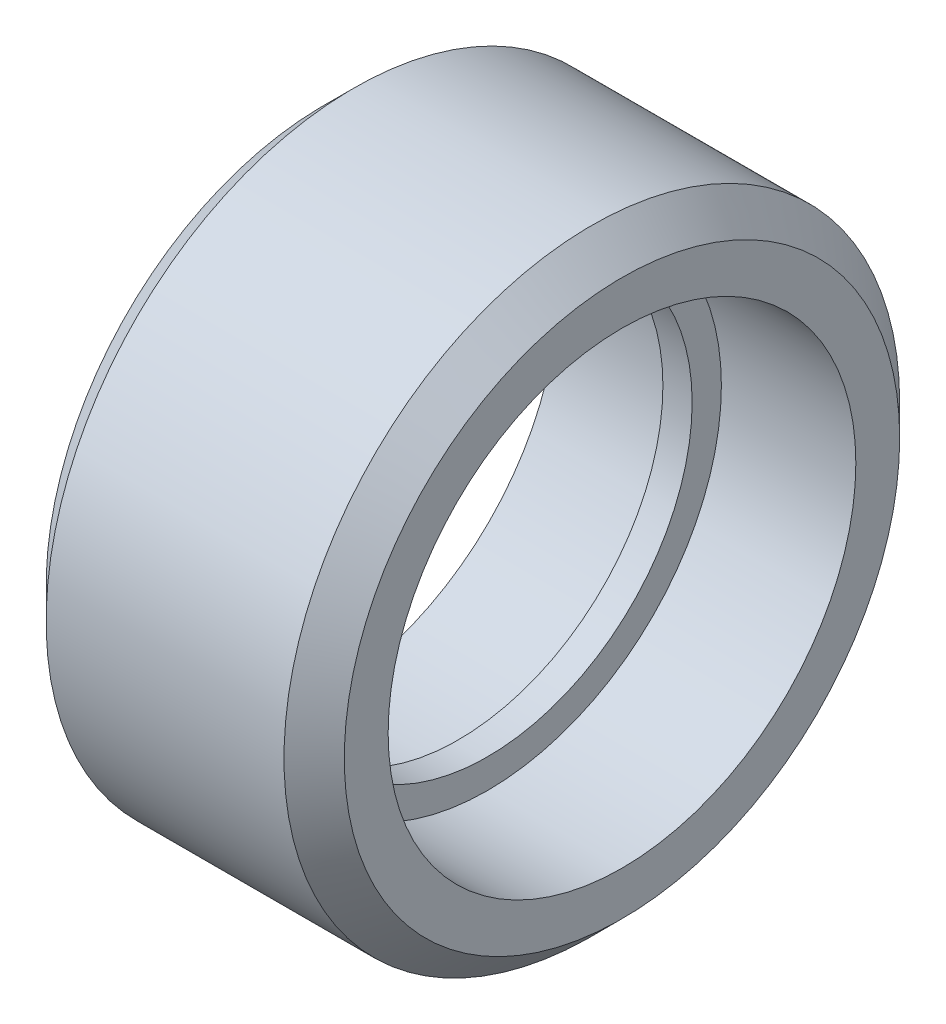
ISO-10303-21;
HEADER;
FILE_DESCRIPTION(('STEP AP214'),'2;1');
FILE_NAME('part.step','',(''),(''),'','','');
FILE_SCHEMA(('AUTOMOTIVE_DESIGN { 1 0 10303 214 1 1 1 1 }'));
ENDSEC;
DATA;
#1=APPLICATION_CONTEXT('core data for automotive mechanical design processes');
#2=APPLICATION_PROTOCOL_DEFINITION('international standard','automotive_design',2000,#1);
#3=PRODUCT_CONTEXT('',#1,'mechanical');
#4=PRODUCT('Part','Part','',(#3));
#5=PRODUCT_RELATED_PRODUCT_CATEGORY('part','',(#4));
#6=PRODUCT_DEFINITION_FORMATION('','',#4);
#7=PRODUCT_DEFINITION_CONTEXT('part definition',#1,'design');
#8=PRODUCT_DEFINITION('design','',#6,#7);
#9=PRODUCT_DEFINITION_SHAPE('','',#8);
#10=(LENGTH_UNIT() NAMED_UNIT(*) SI_UNIT(.MILLI.,.METRE.));
#11=(NAMED_UNIT(*) PLANE_ANGLE_UNIT() SI_UNIT($,.RADIAN.));
#12=(NAMED_UNIT(*) SI_UNIT($,.STERADIAN.) SOLID_ANGLE_UNIT());
#13=UNCERTAINTY_MEASURE_WITH_UNIT(LENGTH_MEASURE(1.E-05),#10,'distance_accuracy_value','');
#14=(GEOMETRIC_REPRESENTATION_CONTEXT(3) GLOBAL_UNCERTAINTY_ASSIGNED_CONTEXT((#13)) GLOBAL_UNIT_ASSIGNED_CONTEXT((#10,
#11,#12)) REPRESENTATION_CONTEXT('',''));
#15=CARTESIAN_POINT('',(0.,0.,0.));
#16=DIRECTION('',(0.,0.,1.));
#17=DIRECTION('',(1.,0.,0.));
#18=AXIS2_PLACEMENT_3D('',#15,#16,#17);
#19=CARTESIAN_POINT('',(0.,0.,0.));
#20=DIRECTION('',(1.,0.,0.));
#21=DIRECTION('',(0.,0.,-1.));
#22=AXIS2_PLACEMENT_3D('',#19,#20,#21);
#23=CYLINDRICAL_SURFACE('',#22,7.);
#24=CARTESIAN_POINT('',(-0.5,0.,0.));
#25=DIRECTION('',(1.,0.,0.));
#26=DIRECTION('',(0.,0.,-1.));
#27=AXIS2_PLACEMENT_3D('',#24,#25,#26);
#28=CIRCLE('',#27,7.);
#29=CARTESIAN_POINT('',(-0.5,0.,-7.));
#30=VERTEX_POINT('',#29);
#31=EDGE_CURVE('E10',#30,#30,#28,.T.);
#32=ORIENTED_EDGE('',*,*,#31,.F.);
#33=EDGE_LOOP('',(#32));
#34=FACE_BOUND('',#33,.T.);
#35=CARTESIAN_POINT('',(0.5,0.,0.));
#36=DIRECTION('',(1.,0.,0.));
#37=DIRECTION('',(0.,0.,-1.));
#38=AXIS2_PLACEMENT_3D('',#35,#36,#37);
#39=CIRCLE('',#38,7.);
#40=CARTESIAN_POINT('',(0.5,0.,-7.));
#41=VERTEX_POINT('',#40);
#42=EDGE_CURVE('E53',#41,#41,#39,.T.);
#43=ORIENTED_EDGE('',*,*,#42,.T.);
#44=EDGE_LOOP('',(#43));
#45=FACE_BOUND('',#44,.T.);
#46=ADVANCED_FACE('F31',(#34,#45),#23,.F.);
#47=CARTESIAN_POINT('',(-0.5,7.,0.));
#48=DIRECTION('',(-1.,0.,0.));
#49=DIRECTION('',(0.,0.,1.));
#50=AXIS2_PLACEMENT_3D('',#47,#48,#49);
#51=PLANE('',#50);
#52=ORIENTED_EDGE('',*,*,#31,.T.);
#53=EDGE_LOOP('',(#52));
#54=FACE_BOUND('',#53,.T.);
#55=CARTESIAN_POINT('',(-0.5,0.,0.));
#56=DIRECTION('',(1.,0.,0.));
#57=DIRECTION('',(0.,0.,-1.));
#58=AXIS2_PLACEMENT_3D('',#55,#56,#57);
#59=CIRCLE('',#58,8.);
#60=CARTESIAN_POINT('',(-0.5,0.,-8.));
#61=VERTEX_POINT('',#60);
#62=EDGE_CURVE('E37',#61,#61,#59,.T.);
#63=ORIENTED_EDGE('',*,*,#62,.F.);
#64=EDGE_LOOP('',(#63));
#65=FACE_BOUND('',#64,.T.);
#66=ADVANCED_FACE('F88',(#54,#65),#51,.T.);
#67=CARTESIAN_POINT('',(0.,0.,0.));
#68=DIRECTION('',(1.,0.,0.));
#69=DIRECTION('',(0.,0.,-1.));
#70=AXIS2_PLACEMENT_3D('',#67,#68,#69);
#71=CYLINDRICAL_SURFACE('',#70,8.);
#72=ORIENTED_EDGE('',*,*,#62,.T.);
#73=EDGE_LOOP('',(#72));
#74=FACE_BOUND('',#73,.T.);
#75=CARTESIAN_POINT('',(-5.1,0.,0.));
#76=DIRECTION('',(1.,0.,0.));
#77=DIRECTION('',(0.,0.,-1.));
#78=AXIS2_PLACEMENT_3D('',#75,#76,#77);
#79=CIRCLE('',#78,8.);
#80=CARTESIAN_POINT('',(-5.1,0.,-8.));
#81=VERTEX_POINT('',#80);
#82=EDGE_CURVE('E41',#81,#81,#79,.T.);
#83=ORIENTED_EDGE('',*,*,#82,.F.);
#84=EDGE_LOOP('',(#83));
#85=FACE_BOUND('',#84,.T.);
#86=ADVANCED_FACE('F93',(#74,#85),#71,.F.);
#87=CARTESIAN_POINT('',(-5.1,8.,0.));
#88=DIRECTION('',(-1.,0.,0.));
#89=DIRECTION('',(0.,0.,1.));
#90=AXIS2_PLACEMENT_3D('',#87,#88,#89);
#91=PLANE('',#90);
#92=ORIENTED_EDGE('',*,*,#82,.T.);
#93=EDGE_LOOP('',(#92));
#94=FACE_BOUND('',#93,.T.);
#95=CARTESIAN_POINT('',(-5.1,0.,0.));
#96=DIRECTION('',(1.,0.,0.));
#97=DIRECTION('',(0.,0.,-1.));
#98=AXIS2_PLACEMENT_3D('',#95,#96,#97);
#99=CIRCLE('',#98,9.5);
#100=CARTESIAN_POINT('',(-5.1,0.,-9.5));
#101=VERTEX_POINT('',#100);
#102=EDGE_CURVE('E45',#101,#101,#99,.T.);
#103=ORIENTED_EDGE('',*,*,#102,.F.);
#104=EDGE_LOOP('',(#103));
#105=FACE_BOUND('',#104,.T.);
#106=ADVANCED_FACE('F84',(#94,#105),#91,.T.);
#107=CARTESIAN_POINT('',(-4.06862955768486,0.,0.));
#108=DIRECTION('',(1.,0.,0.));
#109=DIRECTION('',(0.,0.,-1.));
#110=AXIS2_PLACEMENT_3D('',#107,#108,#109);
#111=CONICAL_SURFACE('',#110,10.5313704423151,0.78539816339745);
#112=ORIENTED_EDGE('',*,*,#102,.T.);
#113=EDGE_LOOP('',(#112));
#114=FACE_BOUND('',#113,.T.);
#115=CARTESIAN_POINT('',(-4.06862955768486,0.,0.));
#116=DIRECTION('',(1.,0.,0.));
#117=DIRECTION('',(0.,0.,-1.));
#118=AXIS2_PLACEMENT_3D('',#115,#116,#117);
#119=CIRCLE('',#118,10.5313704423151);
#120=CARTESIAN_POINT('',(-4.06862955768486,0.,-10.5313704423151));
#121=VERTEX_POINT('',#120);
#122=EDGE_CURVE('E50',#121,#121,#119,.T.);
#123=ORIENTED_EDGE('',*,*,#122,.F.);
#124=EDGE_LOOP('',(#123));
#125=FACE_BOUND('',#124,.T.);
#126=ADVANCED_FACE('F74',(#114,#125),#111,.T.);
#127=CARTESIAN_POINT('',(0.,0.,0.));
#128=DIRECTION('',(1.,0.,0.));
#129=DIRECTION('',(0.,0.,-1.));
#130=AXIS2_PLACEMENT_3D('',#127,#128,#129);
#131=CYLINDRICAL_SURFACE('',#130,10.5313704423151);
#132=ORIENTED_EDGE('',*,*,#122,.T.);
#133=EDGE_LOOP('',(#132));
#134=FACE_BOUND('',#133,.T.);
#135=CARTESIAN_POINT('',(4.06862955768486,0.,0.));
#136=DIRECTION('',(1.,0.,0.));
#137=DIRECTION('',(0.,0.,-1.));
#138=AXIS2_PLACEMENT_3D('',#135,#136,#137);
#139=CIRCLE('',#138,10.5313704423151);
#140=CARTESIAN_POINT('',(4.06862955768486,0.,-10.5313704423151));
#141=VERTEX_POINT('',#140);
#142=EDGE_CURVE('E65',#141,#141,#139,.T.);
#143=ORIENTED_EDGE('',*,*,#142,.F.);
#144=EDGE_LOOP('',(#143));
#145=FACE_BOUND('',#144,.T.);
#146=ADVANCED_FACE('F71',(#134,#145),#131,.T.);
#147=CARTESIAN_POINT('',(0.5,7.,0.));
#148=DIRECTION('',(1.,0.,0.));
#149=DIRECTION('',(0.,0.,1.));
#150=AXIS2_PLACEMENT_3D('',#147,#148,#149);
#151=PLANE('',#150);
#152=ORIENTED_EDGE('',*,*,#42,.F.);
#153=EDGE_LOOP('',(#152));
#154=FACE_BOUND('',#153,.T.);
#155=CARTESIAN_POINT('',(0.5,0.,0.));
#156=DIRECTION('',(1.,0.,0.));
#157=DIRECTION('',(0.,0.,-1.));
#158=AXIS2_PLACEMENT_3D('',#155,#156,#157);
#159=CIRCLE('',#158,8.);
#160=CARTESIAN_POINT('',(0.5,0.,-8.));
#161=VERTEX_POINT('',#160);
#162=EDGE_CURVE('E56',#161,#161,#159,.T.);
#163=ORIENTED_EDGE('',*,*,#162,.T.);
#164=EDGE_LOOP('',(#163));
#165=FACE_BOUND('',#164,.T.);
#166=ADVANCED_FACE('F73',(#154,#165),#151,.T.);
#167=CARTESIAN_POINT('',(0.,0.,0.));
#168=DIRECTION('',(-1.,0.,0.));
#169=DIRECTION('',(0.,0.,-1.));
#170=AXIS2_PLACEMENT_3D('',#167,#168,#169);
#171=CYLINDRICAL_SURFACE('',#170,8.);
#172=ORIENTED_EDGE('',*,*,#162,.F.);
#173=EDGE_LOOP('',(#172));
#174=FACE_BOUND('',#173,.T.);
#175=CARTESIAN_POINT('',(5.1,0.,0.));
#176=DIRECTION('',(1.,0.,0.));
#177=DIRECTION('',(0.,0.,-1.));
#178=AXIS2_PLACEMENT_3D('',#175,#176,#177);
#179=CIRCLE('',#178,8.);
#180=CARTESIAN_POINT('',(5.1,0.,-8.));
#181=VERTEX_POINT('',#180);
#182=EDGE_CURVE('E59',#181,#181,#179,.T.);
#183=ORIENTED_EDGE('',*,*,#182,.T.);
#184=EDGE_LOOP('',(#183));
#185=FACE_BOUND('',#184,.T.);
#186=ADVANCED_FACE('F81',(#174,#185),#171,.F.);
#187=CARTESIAN_POINT('',(5.1,8.,0.));
#188=DIRECTION('',(1.,0.,0.));
#189=DIRECTION('',(0.,0.,1.));
#190=AXIS2_PLACEMENT_3D('',#187,#188,#189);
#191=PLANE('',#190);
#192=ORIENTED_EDGE('',*,*,#182,.F.);
#193=EDGE_LOOP('',(#192));
#194=FACE_BOUND('',#193,.T.);
#195=CARTESIAN_POINT('',(5.1,0.,0.));
#196=DIRECTION('',(1.,0.,0.));
#197=DIRECTION('',(0.,0.,-1.));
#198=AXIS2_PLACEMENT_3D('',#195,#196,#197);
#199=CIRCLE('',#198,9.5);
#200=CARTESIAN_POINT('',(5.1,0.,-9.5));
#201=VERTEX_POINT('',#200);
#202=EDGE_CURVE('E62',#201,#201,#199,.T.);
#203=ORIENTED_EDGE('',*,*,#202,.T.);
#204=EDGE_LOOP('',(#203));
#205=FACE_BOUND('',#204,.T.);
#206=ADVANCED_FACE('F101',(#194,#205),#191,.T.);
#207=CARTESIAN_POINT('',(4.06862955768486,0.,0.));
#208=DIRECTION('',(-1.,0.,0.));
#209=DIRECTION('',(0.,0.,-1.));
#210=AXIS2_PLACEMENT_3D('',#207,#208,#209);
#211=CONICAL_SURFACE('',#210,10.5313704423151,0.78539816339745);
#212=ORIENTED_EDGE('',*,*,#202,.F.);
#213=EDGE_LOOP('',(#212));
#214=FACE_BOUND('',#213,.T.);
#215=ORIENTED_EDGE('',*,*,#142,.T.);
#216=EDGE_LOOP('',(#215));
#217=FACE_BOUND('',#216,.T.);
#218=ADVANCED_FACE('F69',(#214,#217),#211,.T.);
#219=CLOSED_SHELL('',(#46,#66,#86,#106,#126,#146,#166,#186,#206,#218));
#220=MANIFOLD_SOLID_BREP('B2',#219);
#221=ADVANCED_BREP_SHAPE_REPRESENTATION('',(#18,#220),#14);
#222=SHAPE_DEFINITION_REPRESENTATION(#9,#221);
ENDSEC;
END-ISO-10303-21;
